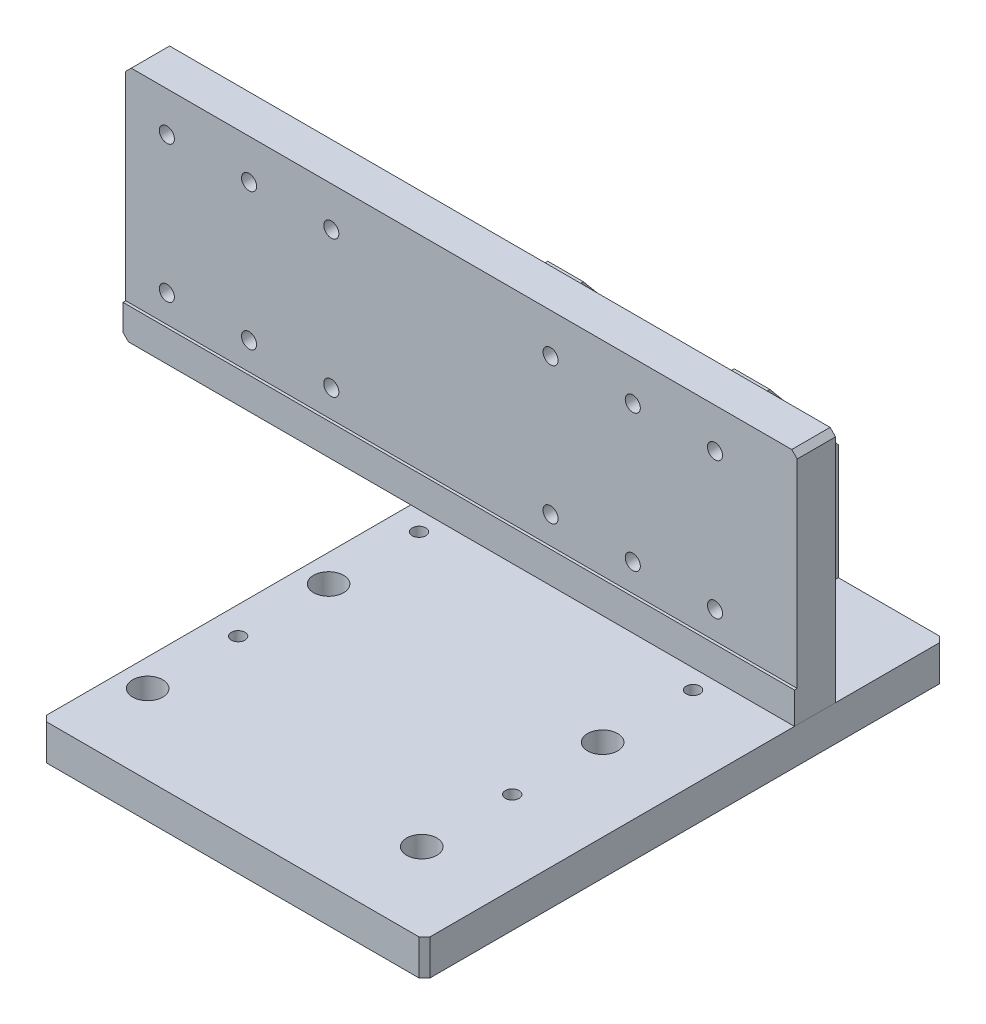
from build123d import *

# Parameters (mm, degrees)
SKETCH_1_W                  = 140
SKETCH_1_H                  = 190
EXTRUDE_1_DEPTH             = 13
SKETCH_2_W                  = 245
SKETCH_2_H                  = 15
EXTRUDE_3_DEPTH             = 86
SKETCH_3_W                  = 245
SKETCH_3_H                  = 74.5
CUT_EXTRUDE_1_DEPTH         = 1
SKETCH_4_W                  = 13
SKETCH_4_H                  = 40
EXTRUDE_4_DEPTH             = 72
EXTRUDE_4_2_DEPTH           = 72
CUT_EXTRUDE_2_DEPTH         = 186.609805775
HOLE_WIZARD_M6_1_AT_2_COUNT = 2
HOLE_WIZARD_M6_1_AT_2_PITCH = 100
HOLE_WIZARD_M6_1_AT_3_COUNT = 2
HOLE_WIZARD_M6_1_AT_3_PITCH = 66
HOLE_WIZARD_M6_1_AT_4_COUNT = 2
HOLE_WIZARD_M6_1_AT_4_PITCH = 132
HOLE_WIZARD_M6_1_AT_5_COUNT = 2
HOLE_WIZARD_M6_1_AT_5_PITCH = 165.601932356
HOLE_WIZARD_M6_1_AT_6_COUNT = 2
HOLE_WIZARD_M6_1_AT_6_PITCH = 119.816526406
SKETCH_9_W                  = 2.5
SKETCH_9_H                  = 13
F_5_0MM_1_AT_2_COUNT        = 2
F_5_0MM_1_AT_2_PITCH        = 100
F_5_0MM_1_AT_3_COUNT        = 2
F_5_0MM_1_AT_3_PITCH        = 66
F_5_0MM_1_AT_4_COUNT        = 2
F_5_0MM_1_AT_4_PITCH        = 119.816526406
HOLE_WIZARD_M5_1_AT_2_COUNT = 2
HOLE_WIZARD_M5_1_AT_2_PITCH = 30
HOLE_WIZARD_M5_1_AT_3_COUNT = 2
HOLE_WIZARD_M5_1_AT_3_PITCH = 60
HOLE_WIZARD_M5_1_AT_4_COUNT = 2
HOLE_WIZARD_M5_1_AT_4_PITCH = 50
HOLE_WIZARD_M5_1_AT_5_COUNT = 2
HOLE_WIZARD_M5_1_AT_5_PITCH = 58.309518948
HOLE_WIZARD_M5_1_AT_6_COUNT = 2
HOLE_WIZARD_M5_1_AT_6_PITCH = 78.102496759
CHAMFER_1_SIZE              = 2
CHAMFER_2_SIZE              = 2
PATTERN_LINEAR_1_COUNT      = 2
PATTERN_LINEAR_1_PITCH      = 140


with BuildPart() as part:
    # Sketch 1 → Extrude 1 (new body)
    with BuildSketch(Plane(origin=(0, 0, 0), x_dir=(1, 0, 0), z_dir=(0, 1, 0))):
        Rectangle(SKETCH_1_W, SKETCH_1_H)
    extrude(amount=EXTRUDE_1_DEPTH)

    # Sketch 7 → Hole Wizard M6 _ _ _ _ _1 (revolve, cut)
    with BuildSketch(Plane(origin=(-60, 13, -66), x_dir=(0, 0, 1), z_dir=(1, 0, 0))):
        Polygon((0, 0), (0, 13), (3.3, 13), (3.3, 8), (5.5, 8), (5.5, 0), align=None)
    hole_wizard_m6_1 = revolve(axis=Axis((-60, 19.35, -66), (0, -1, 0)), mode=Mode.SUBTRACT)

    # Hole Wizard M6 _ _ _ _ _1 at 2: Hole Wizard M6 _ _ _ _ _1 ×2
    with Locations(*[(i * HOLE_WIZARD_M6_1_AT_2_PITCH, 0, 0) for i in range(1, HOLE_WIZARD_M6_1_AT_2_COUNT)]):
        add(hole_wizard_m6_1, mode=Mode.SUBTRACT)

    # Hole Wizard M6 _ _ _ _ _1 at 3: Hole Wizard M6 _ _ _ _ _1 ×2
    with Locations(*[(0, 0, i * HOLE_WIZARD_M6_1_AT_3_PITCH) for i in range(1, HOLE_WIZARD_M6_1_AT_3_COUNT)]):
        add(hole_wizard_m6_1, mode=Mode.SUBTRACT)

    # Hole Wizard M6 _ _ _ _ _1 at 4: Hole Wizard M6 _ _ _ _ _1 ×2
    with Locations(*[(0, 0, i * HOLE_WIZARD_M6_1_AT_4_PITCH) for i in range(1, HOLE_WIZARD_M6_1_AT_4_COUNT)]):
        add(hole_wizard_m6_1, mode=Mode.SUBTRACT)

    # Hole Wizard M6 _ _ _ _ _1 at 5: Hole Wizard M6 _ _ _ _ _1 ×2
    with Locations(*[Vector(0.6038576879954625, 0, 0.7970921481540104) * (i * HOLE_WIZARD_M6_1_AT_5_PITCH) for i in range(1, HOLE_WIZARD_M6_1_AT_5_COUNT)]):
        add(hole_wizard_m6_1, mode=Mode.SUBTRACT)

    # Hole Wizard M6 _ _ _ _ _1 at 6: Hole Wizard M6 _ _ _ _ _1 ×2
    with Locations(*[Vector(0.8346094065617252, 0, 0.5508422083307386) * (i * HOLE_WIZARD_M6_1_AT_6_PITCH) for i in range(1, HOLE_WIZARD_M6_1_AT_6_COUNT)]):
        add(hole_wizard_m6_1, mode=Mode.SUBTRACT)

    # Sketch 9 → 5.0mm _ _1 (revolve, cut)
    with BuildSketch(Plane(origin=(-60, 13, -33), x_dir=(0, 0, 1), z_dir=(1, 0, 0))):
        with Locations((1.25, 6.5)):
            Rectangle(SKETCH_9_W, SKETCH_9_H)
    f_5_0mm_1 = revolve(axis=Axis((-60, 19.35, -33), (0, -1, 0)), mode=Mode.SUBTRACT)

    # 5.0mm _ _1 at 2: 5.0mm _ _1 ×2
    with Locations(*[(i * F_5_0MM_1_AT_2_PITCH, 0, 0) for i in range(1, F_5_0MM_1_AT_2_COUNT)]):
        add(f_5_0mm_1, mode=Mode.SUBTRACT)

    # 5.0mm _ _1 at 3: 5.0mm _ _1 ×2
    with Locations(*[(0, 0, i * F_5_0MM_1_AT_3_PITCH) for i in range(1, F_5_0MM_1_AT_3_COUNT)]):
        add(f_5_0mm_1, mode=Mode.SUBTRACT)

    # 5.0mm _ _1 at 4: 5.0mm _ _1 ×2
    with Locations(*[Vector(0.8346094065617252, 0, 0.5508422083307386) * (i * F_5_0MM_1_AT_4_PITCH) for i in range(1, F_5_0MM_1_AT_4_COUNT)]):
        add(f_5_0mm_1, mode=Mode.SUBTRACT)

    # Chamfer 2
    chamfer_2_edges = [part.edges().sort_by_distance(p)[0] for p in [
        (70, 6.5, 95),
        (-70, 6.5, 95),
        (-70, 6.5, -95),
        (70, 6.5, -95),
    ]]
    chamfer(chamfer_2_edges, length=CHAMFER_2_SIZE)


with BuildPart() as body_2:
    # Sketch 2 → Extrude 3 (new body)
    with BuildSketch(Plane(origin=(0, 13, 0), x_dir=(1, 0, 0), z_dir=(0, 1, 0))):
        with Locations((-52.5, 47.5)):
            Rectangle(SKETCH_2_W, SKETCH_2_H)
    extrude(amount=EXTRUDE_3_DEPTH)

    # Sketch 3 → Cut-Extrude 1 (cut)
    with BuildSketch(Plane.XY.offset(-40)):
        with Locations((-52.5, 61.75)):
            Rectangle(SKETCH_3_W, SKETCH_3_H)
    extrude(amount=-CUT_EXTRUDE_1_DEPTH, mode=Mode.SUBTRACT)

    # Sketch 11 → Hole Wizard M5 _ _ _ _ _1 (revolve, cut)
    with BuildSketch(Plane(origin=(40, 84.5, -55), x_dir=(0, 1, 0), z_dir=(1, 0, 0))):
        Polygon((0, 0), (0, 150), (2.75, 150), (2.75, 8), (4.75, 8), (4.75, 0), align=None)
    hole_wizard_m5_1 = revolve(axis=Axis((40, 84.5, -61.35), (0, 0, 1)), mode=Mode.SUBTRACT)

    # Hole Wizard M5 _ _ _ _ _1 at 2: Hole Wizard M5 _ _ _ _ _1 ×2
    with Locations(*[(-i * HOLE_WIZARD_M5_1_AT_2_PITCH, 0, 0) for i in range(1, HOLE_WIZARD_M5_1_AT_2_COUNT)]):
        add(hole_wizard_m5_1, mode=Mode.SUBTRACT)

    # Hole Wizard M5 _ _ _ _ _1 at 3: Hole Wizard M5 _ _ _ _ _1 ×2
    with Locations(*[(-i * HOLE_WIZARD_M5_1_AT_3_PITCH, 0, 0) for i in range(1, HOLE_WIZARD_M5_1_AT_3_COUNT)]):
        add(hole_wizard_m5_1, mode=Mode.SUBTRACT)

    # Hole Wizard M5 _ _ _ _ _1 at 4: Hole Wizard M5 _ _ _ _ _1 ×2
    with Locations(*[(0, -i * HOLE_WIZARD_M5_1_AT_4_PITCH, 0) for i in range(1, HOLE_WIZARD_M5_1_AT_4_COUNT)]):
        add(hole_wizard_m5_1, mode=Mode.SUBTRACT)

    # Hole Wizard M5 _ _ _ _ _1 at 5: Hole Wizard M5 _ _ _ _ _1 ×2
    with Locations(*[Vector(-0.5144957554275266, -0.8574929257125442, 0) * (i * HOLE_WIZARD_M5_1_AT_5_PITCH) for i in range(1, HOLE_WIZARD_M5_1_AT_5_COUNT)]):
        add(hole_wizard_m5_1, mode=Mode.SUBTRACT)

    # Hole Wizard M5 _ _ _ _ _1 at 6: Hole Wizard M5 _ _ _ _ _1 ×2
    with Locations(*[Vector(-0.7682212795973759, -0.6401843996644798, 0) * (i * HOLE_WIZARD_M5_1_AT_6_PITCH) for i in range(1, HOLE_WIZARD_M5_1_AT_6_COUNT)]):
        add(hole_wizard_m5_1, mode=Mode.SUBTRACT)

    # Chamfer 1
    chamfer_1_edges = [body_2.edges().sort_by_distance(p)[0] for p in [
        (-175, 99, -48),
        (70, 99, -48),
        (-175, 13, -47.5),
    ]]
    chamfer(chamfer_1_edges, length=CHAMFER_1_SIZE)

    # Pattern Linear 1: Hole Wizard M5 _ _ _ _ _1 ×2
    with Locations(*[(-i * PATTERN_LINEAR_1_PITCH, 0, 0) for i in range(1, PATTERN_LINEAR_1_COUNT)]):
        add(hole_wizard_m5_1, mode=Mode.SUBTRACT)

    # Pattern Linear 1 copy 1 sketch → Pattern Linear 1 copy 1 (revolve, cut)
    with BuildSketch(Plane(origin=(-130, 84.5, -55), x_dir=(0, 1, 0), z_dir=(1, 0, 0))):
        Polygon((0, 0), (0, 150), (2.75, 150), (2.75, 8), (4.75, 8), (4.75, 0), align=None)
    revolve(axis=Axis((-130, 84.5, -61.35), (0, 0, 1)), mode=Mode.SUBTRACT)

    # Pattern Linear 1 copy 2 sketch → Pattern Linear 1 copy 2 (revolve, cut)
    with BuildSketch(Plane(origin=(-160, 84.5, -55), x_dir=(0, 1, 0), z_dir=(1, 0, 0))):
        Polygon((0, 0), (0, 150), (2.75, 150), (2.75, 8), (4.75, 8), (4.75, 0), align=None)
    revolve(axis=Axis((-160, 84.5, -61.35), (0, 0, 1)), mode=Mode.SUBTRACT)

    # Pattern Linear 1 copy 3 sketch → Pattern Linear 1 copy 3 (revolve, cut)
    with BuildSketch(Plane(origin=(-100, 34.5, -55), x_dir=(0, 1, 0), z_dir=(1, 0, 0))):
        Polygon((0, 0), (0, 150), (2.75, 150), (2.75, 8), (4.75, 8), (4.75, 0), align=None)
    revolve(axis=Axis((-100, 34.5, -61.35), (0, 0, 1)), mode=Mode.SUBTRACT)

    # Pattern Linear 1 copy 4 sketch → Pattern Linear 1 copy 4 (revolve, cut)
    with BuildSketch(Plane(origin=(-130, 34.5, -55), x_dir=(0, 1, 0), z_dir=(1, 0, 0))):
        Polygon((0, 0), (0, 150), (2.75, 150), (2.75, 8), (4.75, 8), (4.75, 0), align=None)
    revolve(axis=Axis((-130, 34.5, -61.35), (0, 0, 1)), mode=Mode.SUBTRACT)

    # Pattern Linear 1 copy 5 sketch → Pattern Linear 1 copy 5 (revolve, cut)
    with BuildSketch(Plane(origin=(-160, 34.5, -55), x_dir=(0, 1, 0), z_dir=(1, 0, 0))):
        Polygon((0, 0), (0, 150), (2.75, 150), (2.75, 8), (4.75, 8), (4.75, 0), align=None)
    revolve(axis=Axis((-160, 34.5, -61.35), (0, 0, 1)), mode=Mode.SUBTRACT)


with BuildPart() as body_3:
    # Sketch 4 → Extrude 4 (new body)
    with BuildSketch(Plane(origin=(0, 13, 0), x_dir=(1, 0, 0), z_dir=(0, 1, 0))):
        with Locations((-43.5, 75)):
            Rectangle(SKETCH_4_W, SKETCH_4_H)
    extrude(amount=EXTRUDE_4_DEPTH)


with BuildPart() as body_4:
    # Sketch 4 → Extrude 4 2 (new body)
    with BuildSketch(Plane(origin=(0, 13, 0), x_dir=(1, 0, 0), z_dir=(0, 1, 0))):
        with Locations((24.5, 75)):
            Rectangle(SKETCH_4_W, SKETCH_4_H)
    extrude(amount=EXTRUDE_4_2_DEPTH)


with BuildPart() as cut_extrude_2_tool:
    # Sketch 5 → Cut-Extrude 2 (new, through all)
    with BuildSketch(Plane.ZY.offset(50)):
        Polygon((-95, 85), (-95, 55), (-70, 85), align=None)
    extrude(amount=-CUT_EXTRUDE_2_DEPTH)


with BuildPart() as body_3_1:
    add(body_3.part)

    # Cut-Extrude 2: cut by cut_extrude_2_tool
    add(cut_extrude_2_tool.part, mode=Mode.SUBTRACT)


with BuildPart() as body_4_1:
    add(body_4.part)

    # Cut-Extrude 2: cut by cut_extrude_2_tool
    add(cut_extrude_2_tool.part, mode=Mode.SUBTRACT)


solid = Compound([part.part, body_2.part, body_3_1.part, body_4_1.part])
